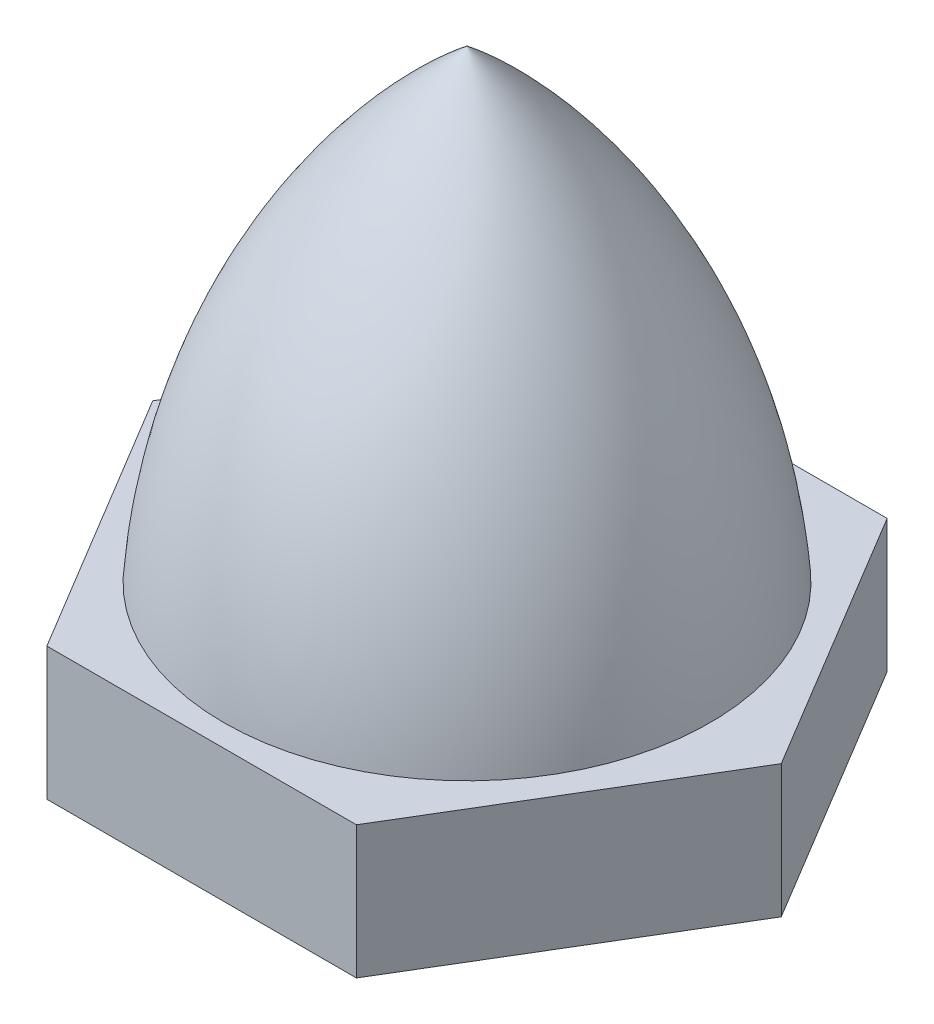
from build123d import *

# Parameters (mm, degrees)
ECROU_DEPTH              = 3
ESQUISSE3_R              = 2.5
PASSAGE_AXE_MOTEUR_DEPTH = 10.5


with BuildPart() as part:
    # Esquisse1 → c_ne (revolve)
    with BuildSketch(Plane.XY):
        with BuildLine():
            Line((0, 0), (5.5, 0))
            ThreePointArc((5.5, 0), (3.831145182, 5.816314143), (0, 10.5))
            Line((0, 10.5), (0, 0))
        make_face()
    revolve(axis=Axis((0, 10.5, 0), (0, -1, 0)))

    # Esquisse2 → ecrou (add)
    with BuildSketch(Plane.XZ):
        Polygon((-3.5, 6), (3.5, 6), (7.105551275, 0), (3.5, -6), (-3.5, -6), (-7.105551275, 0), align=None)
    extrude(amount=ECROU_DEPTH)

    # Esquisse3 → passage axe moteur (cut)
    with BuildSketch(Plane.XZ.offset(3)):
        with Locations(Location((0, 0, 0), (0, 0, 270))):
            Circle(ESQUISSE3_R)
    extrude(amount=-PASSAGE_AXE_MOTEUR_DEPTH, mode=Mode.SUBTRACT)


solid = part.part
